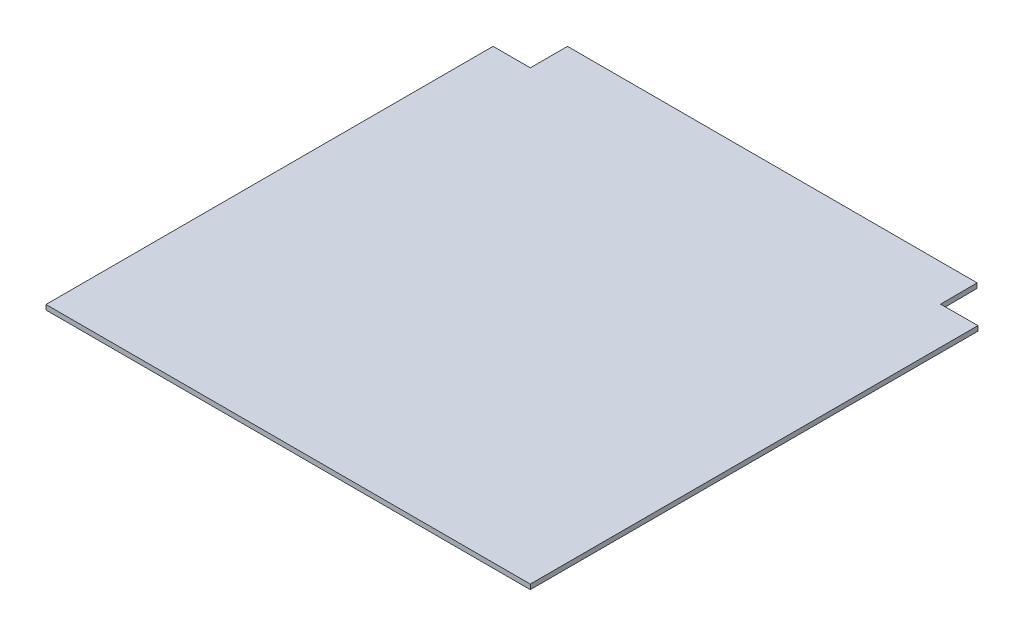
from build123d import *

# Parameters (mm, degrees)
BOSS_EXTRUDE1_DEPTH = 10


with BuildPart() as part:
    # Sketch1 → Boss-Extrude1 (new body)
    with BuildSketch(Plane(origin=(0, 0, 0), x_dir=(1, 0, 0), z_dir=(0, 1, 0))):
        Polygon((-446.762811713, 370.745347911), (-523.495094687, 370.745347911), (-523.495094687, -550.856779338), (474.747546, -550.856779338), (474.747546, 372.013350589), (397.930322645, 371.634174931), (397.556406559, 447.385861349), (-446.762811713, 447.385861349), align=None)
    extrude(amount=BOSS_EXTRUDE1_DEPTH)


solid = part.part
